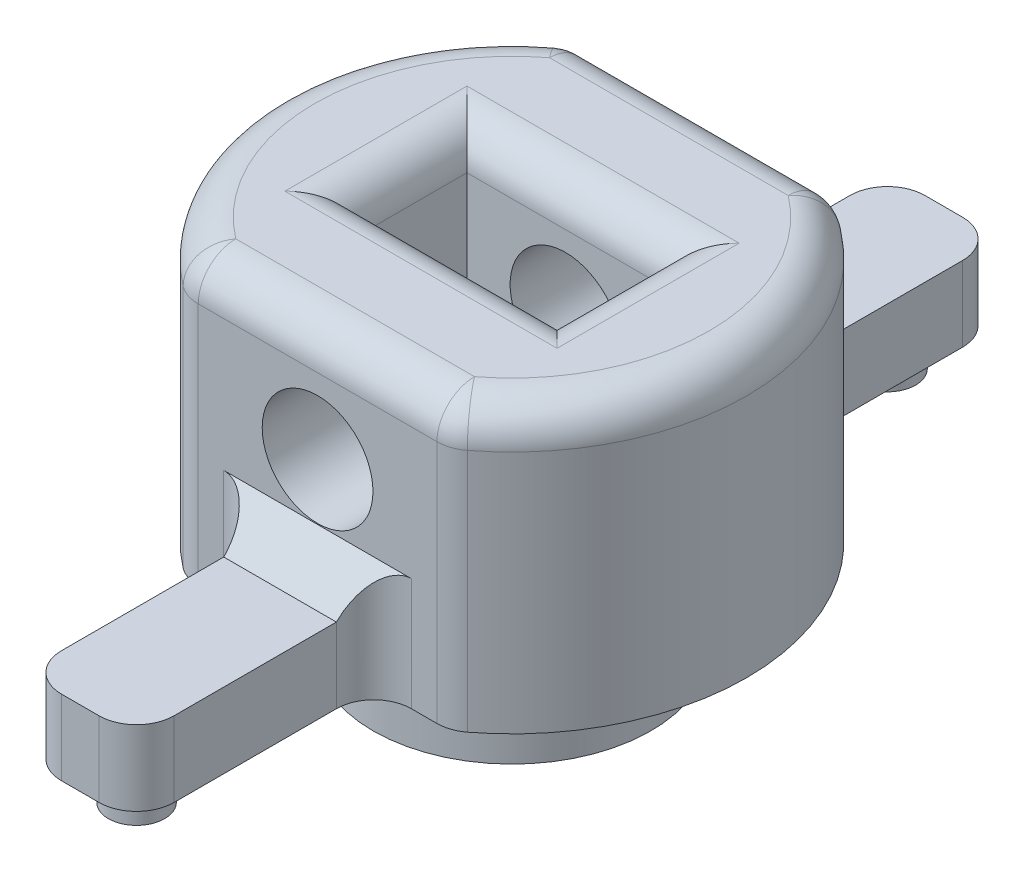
ISO-10303-21;
HEADER;
FILE_DESCRIPTION(('STEP AP214'),'2;1');
FILE_NAME('part.step','',(''),(''),'','','');
FILE_SCHEMA(('AUTOMOTIVE_DESIGN { 1 0 10303 214 1 1 1 1 }'));
ENDSEC;
DATA;
#1=APPLICATION_CONTEXT('core data for automotive mechanical design processes');
#2=APPLICATION_PROTOCOL_DEFINITION('international standard','automotive_design',2000,#1);
#3=PRODUCT_CONTEXT('',#1,'mechanical');
#4=PRODUCT('Part','Part','',(#3));
#5=PRODUCT_RELATED_PRODUCT_CATEGORY('part','',(#4));
#6=PRODUCT_DEFINITION_FORMATION('','',#4);
#7=PRODUCT_DEFINITION_CONTEXT('part definition',#1,'design');
#8=PRODUCT_DEFINITION('design','',#6,#7);
#9=PRODUCT_DEFINITION_SHAPE('','',#8);
#10=(LENGTH_UNIT() NAMED_UNIT(*) SI_UNIT(.MILLI.,.METRE.));
#11=(NAMED_UNIT(*) PLANE_ANGLE_UNIT() SI_UNIT($,.RADIAN.));
#12=(NAMED_UNIT(*) SI_UNIT($,.STERADIAN.) SOLID_ANGLE_UNIT());
#13=UNCERTAINTY_MEASURE_WITH_UNIT(LENGTH_MEASURE(1.E-05),#10,'distance_accuracy_value','');
#14=(GEOMETRIC_REPRESENTATION_CONTEXT(3) GLOBAL_UNCERTAINTY_ASSIGNED_CONTEXT((#13)) GLOBAL_UNIT_ASSIGNED_CONTEXT((#10,
#11,#12)) REPRESENTATION_CONTEXT('',''));
#15=CARTESIAN_POINT('',(0.,0.,0.));
#16=DIRECTION('',(0.,0.,1.));
#17=DIRECTION('',(1.,0.,0.));
#18=AXIS2_PLACEMENT_3D('',#15,#16,#17);
#19=CARTESIAN_POINT('',(0.,9.,-12.5));
#20=DIRECTION('',(0.,0.,1.));
#21=DIRECTION('',(1.,0.,0.));
#22=AXIS2_PLACEMENT_3D('',#19,#20,#21);
#23=CYLINDRICAL_SURFACE('',#22,2.95);
#24=CARTESIAN_POINT('',(0.,9.,-10.356157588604));
#25=DIRECTION('',(0.,0.,1.));
#26=DIRECTION('',(1.,0.,0.));
#27=AXIS2_PLACEMENT_3D('',#24,#25,#26);
#28=CIRCLE('',#27,2.95);
#29=CARTESIAN_POINT('',(2.95,9.,-10.356157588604));
#30=VERTEX_POINT('',#29);
#31=EDGE_CURVE('E419',#30,#30,#28,.F.);
#32=ORIENTED_EDGE('',*,*,#31,.T.);
#33=EDGE_LOOP('',(#32));
#34=FACE_BOUND('',#33,.T.);
#35=CARTESIAN_POINT('',(0.,9.,-2.85));
#36=DIRECTION('',(0.,0.,1.));
#37=DIRECTION('',(1.,0.,0.));
#38=AXIS2_PLACEMENT_3D('',#35,#36,#37);
#39=CIRCLE('',#38,2.95);
#40=CARTESIAN_POINT('',(2.95,9.,-2.85));
#41=VERTEX_POINT('',#40);
#42=EDGE_CURVE('E299',#41,#41,#39,.F.);
#43=ORIENTED_EDGE('',*,*,#42,.F.);
#44=EDGE_LOOP('',(#43));
#45=FACE_BOUND('',#44,.T.);
#46=ADVANCED_FACE('F49',(#34,#45),#23,.F.);
#47=CARTESIAN_POINT('',(0.,20.,0.));
#48=DIRECTION('',(0.,-1.,0.));
#49=DIRECTION('',(0.,0.,-1.));
#50=AXIS2_PLACEMENT_3D('',#47,#48,#49);
#51=CYLINDRICAL_SURFACE('',#50,1.5);
#52=CARTESIAN_POINT('',(0.,-5.,0.));
#53=DIRECTION('',(0.,1.,0.));
#54=DIRECTION('',(0.,0.,1.));
#55=AXIS2_PLACEMENT_3D('',#52,#53,#54);
#56=CIRCLE('',#55,1.5);
#57=CARTESIAN_POINT('',(0.,-5.,1.5));
#58=VERTEX_POINT('',#57);
#59=EDGE_CURVE('E420',#58,#58,#56,.T.);
#60=ORIENTED_EDGE('',*,*,#59,.F.);
#61=EDGE_LOOP('',(#60));
#62=FACE_BOUND('',#61,.T.);
#63=CARTESIAN_POINT('',(0.,2.93782217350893,0.));
#64=DIRECTION('',(-0.5,0.866025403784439,0.));
#65=DIRECTION('',(-0.866025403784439,-0.5,0.));
#66=AXIS2_PLACEMENT_3D('',#63,#64,#65);
#67=ELLIPSE('',#66,1.73205080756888,1.5);
#68=CARTESIAN_POINT('',(0.,2.93782217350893,-1.5));
#69=VERTEX_POINT('',#68);
#70=CARTESIAN_POINT('',(0.,2.93782217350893,1.5));
#71=VERTEX_POINT('',#70);
#72=EDGE_CURVE('E13',#69,#71,#67,.F.);
#73=ORIENTED_EDGE('',*,*,#72,.F.);
#74=CARTESIAN_POINT('',(0.,2.93782217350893,0.));
#75=DIRECTION('',(0.5,0.866025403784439,0.));
#76=DIRECTION('',(0.866025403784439,-0.5,0.));
#77=AXIS2_PLACEMENT_3D('',#74,#75,#76);
#78=ELLIPSE('',#77,1.73205080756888,1.5);
#79=EDGE_CURVE('E64',#71,#69,#78,.F.);
#80=ORIENTED_EDGE('',*,*,#79,.F.);
#81=EDGE_LOOP('',(#73,#80));
#82=FACE_BOUND('',#81,.T.);
#83=ADVANCED_FACE('F269',(#62,#82),#51,.F.);
#84=CARTESIAN_POINT('',(-7.,-5.,10.356157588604));
#85=DIRECTION('',(0.,0.,-1.));
#86=DIRECTION('',(-1.,0.,0.));
#87=AXIS2_PLACEMENT_3D('',#84,#85,#86);
#88=PLANE('',#87);
#89=CARTESIAN_POINT('',(0.,9.,10.356157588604));
#90=DIRECTION('',(0.,0.,-1.));
#91=DIRECTION('',(-1.,0.,0.));
#92=AXIS2_PLACEMENT_3D('',#89,#90,#91);
#93=CIRCLE('',#92,2.95);
#94=CARTESIAN_POINT('',(-2.95,9.,10.356157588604));
#95=VERTEX_POINT('',#94);
#96=EDGE_CURVE('E408',#95,#95,#93,.F.);
#97=ORIENTED_EDGE('',*,*,#96,.F.);
#98=EDGE_LOOP('',(#97));
#99=FACE_BOUND('',#98,.T.);
#100=DIRECTION('',(0.,-1.,0.));
#101=VECTOR('',#100,1.);
#102=CARTESIAN_POINT('',(6.35803667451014,-5.,10.356157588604));
#103=LINE('',#102,#101);
#104=CARTESIAN_POINT('',(6.35803667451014,0.,10.356157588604));
#105=VERTEX_POINT('',#104);
#106=CARTESIAN_POINT('',(6.35803667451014,13.,10.356157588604));
#107=VERTEX_POINT('',#106);
#108=EDGE_CURVE('E467',#105,#107,#103,.F.);
#109=ORIENTED_EDGE('',*,*,#108,.T.);
#110=DIRECTION('',(-1.,0.,0.));
#111=VECTOR('',#110,1.);
#112=CARTESIAN_POINT('',(-6.35803667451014,13.,10.356157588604));
#113=LINE('',#112,#111);
#114=CARTESIAN_POINT('',(-6.35803667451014,13.,10.356157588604));
#115=VERTEX_POINT('',#114);
#116=EDGE_CURVE('E600',#107,#115,#113,.T.);
#117=ORIENTED_EDGE('',*,*,#116,.T.);
#118=DIRECTION('',(0.,-1.,0.));
#119=VECTOR('',#118,1.);
#120=CARTESIAN_POINT('',(-6.35803667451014,-5.,10.356157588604));
#121=LINE('',#120,#119);
#122=CARTESIAN_POINT('',(-6.35803667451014,0.,10.356157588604));
#123=VERTEX_POINT('',#122);
#124=EDGE_CURVE('E475',#115,#123,#121,.T.);
#125=ORIENTED_EDGE('',*,*,#124,.T.);
#126=DIRECTION('',(-1.,0.,0.));
#127=VECTOR('',#126,1.);
#128=CARTESIAN_POINT('',(0.,0.,10.356157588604));
#129=LINE('',#128,#127);
#130=CARTESIAN_POINT('',(-5.,0.,10.356157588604));
#131=VERTEX_POINT('',#130);
#132=EDGE_CURVE('E409',#131,#123,#129,.T.);
#133=ORIENTED_EDGE('',*,*,#132,.F.);
#134=DIRECTION('',(0.,-1.,0.));
#135=VECTOR('',#134,1.);
#136=CARTESIAN_POINT('',(-5.,6.,10.356157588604));
#137=LINE('',#136,#135);
#138=CARTESIAN_POINT('',(-5.,6.,10.356157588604));
#139=VERTEX_POINT('',#138);
#140=EDGE_CURVE('E478',#131,#139,#137,.F.);
#141=ORIENTED_EDGE('',*,*,#140,.T.);
#142=DIRECTION('',(1.,0.,0.));
#143=VECTOR('',#142,1.);
#144=CARTESIAN_POINT('',(-7.,6.,10.356157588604));
#145=LINE('',#144,#143);
#146=CARTESIAN_POINT('',(5.,6.,10.356157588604));
#147=VERTEX_POINT('',#146);
#148=EDGE_CURVE('E456',#139,#147,#145,.T.);
#149=ORIENTED_EDGE('',*,*,#148,.T.);
#150=DIRECTION('',(0.,-1.,0.));
#151=VECTOR('',#150,1.);
#152=CARTESIAN_POINT('',(5.,-5.,10.356157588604));
#153=LINE('',#152,#151);
#154=CARTESIAN_POINT('',(5.,0.,10.356157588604));
#155=VERTEX_POINT('',#154);
#156=EDGE_CURVE('E471',#147,#155,#153,.T.);
#157=ORIENTED_EDGE('',*,*,#156,.T.);
#158=EDGE_CURVE('E413',#105,#155,#129,.T.);
#159=ORIENTED_EDGE('',*,*,#158,.F.);
#160=EDGE_LOOP('',(#109,#117,#125,#133,#141,#149,#157,#159));
#161=FACE_BOUND('',#160,.T.);
#162=ADVANCED_FACE('F735',(#99,#161),#88,.F.);
#163=CARTESIAN_POINT('',(-7.,-5.,-10.356157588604));
#164=DIRECTION('',(0.,0.,1.));
#165=DIRECTION('',(1.,0.,0.));
#166=AXIS2_PLACEMENT_3D('',#163,#164,#165);
#167=PLANE('',#166);
#168=ORIENTED_EDGE('',*,*,#31,.F.);
#169=EDGE_LOOP('',(#168));
#170=FACE_BOUND('',#169,.T.);
#171=DIRECTION('',(0.,-1.,0.));
#172=VECTOR('',#171,1.);
#173=CARTESIAN_POINT('',(-6.35803667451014,-5.,-10.356157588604));
#174=LINE('',#173,#172);
#175=CARTESIAN_POINT('',(-6.35803667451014,0.,-10.356157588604));
#176=VERTEX_POINT('',#175);
#177=CARTESIAN_POINT('',(-6.35803667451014,13.,-10.356157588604));
#178=VERTEX_POINT('',#177);
#179=EDGE_CURVE('E514',#176,#178,#174,.F.);
#180=ORIENTED_EDGE('',*,*,#179,.T.);
#181=DIRECTION('',(1.,0.,0.));
#182=VECTOR('',#181,1.);
#183=CARTESIAN_POINT('',(6.35803667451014,13.,-10.356157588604));
#184=LINE('',#183,#182);
#185=CARTESIAN_POINT('',(6.35803667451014,13.,-10.356157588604));
#186=VERTEX_POINT('',#185);
#187=EDGE_CURVE('E562',#178,#186,#184,.T.);
#188=ORIENTED_EDGE('',*,*,#187,.T.);
#189=DIRECTION('',(0.,-1.,0.));
#190=VECTOR('',#189,1.);
#191=CARTESIAN_POINT('',(6.35803667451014,-5.,-10.356157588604));
#192=LINE('',#191,#190);
#193=CARTESIAN_POINT('',(6.35803667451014,0.,-10.356157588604));
#194=VERTEX_POINT('',#193);
#195=EDGE_CURVE('E522',#186,#194,#192,.T.);
#196=ORIENTED_EDGE('',*,*,#195,.T.);
#197=DIRECTION('',(1.,0.,0.));
#198=VECTOR('',#197,1.);
#199=CARTESIAN_POINT('',(0.,0.,-10.356157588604));
#200=LINE('',#199,#198);
#201=CARTESIAN_POINT('',(5.,0.,-10.356157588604));
#202=VERTEX_POINT('',#201);
#203=EDGE_CURVE('E414',#202,#194,#200,.T.);
#204=ORIENTED_EDGE('',*,*,#203,.F.);
#205=DIRECTION('',(0.,1.,0.));
#206=VECTOR('',#205,1.);
#207=CARTESIAN_POINT('',(5.,-5.,-10.356157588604));
#208=LINE('',#207,#206);
#209=CARTESIAN_POINT('',(5.,6.,-10.356157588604));
#210=VERTEX_POINT('',#209);
#211=EDGE_CURVE('E518',#202,#210,#208,.T.);
#212=ORIENTED_EDGE('',*,*,#211,.T.);
#213=DIRECTION('',(-1.,0.,0.));
#214=VECTOR('',#213,1.);
#215=CARTESIAN_POINT('',(-7.,6.,-10.356157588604));
#216=LINE('',#215,#214);
#217=CARTESIAN_POINT('',(-5.,6.,-10.356157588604));
#218=VERTEX_POINT('',#217);
#219=EDGE_CURVE('E434',#210,#218,#216,.T.);
#220=ORIENTED_EDGE('',*,*,#219,.T.);
#221=DIRECTION('',(0.,1.,0.));
#222=VECTOR('',#221,1.);
#223=CARTESIAN_POINT('',(-5.,0.,-10.356157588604));
#224=LINE('',#223,#222);
#225=CARTESIAN_POINT('',(-5.,0.,-10.356157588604));
#226=VERTEX_POINT('',#225);
#227=EDGE_CURVE('E511',#218,#226,#224,.F.);
#228=ORIENTED_EDGE('',*,*,#227,.T.);
#229=EDGE_CURVE('E418',#176,#226,#200,.T.);
#230=ORIENTED_EDGE('',*,*,#229,.F.);
#231=EDGE_LOOP('',(#180,#188,#196,#204,#212,#220,#228,#230));
#232=FACE_BOUND('',#231,.T.);
#233=ADVANCED_FACE('F759',(#170,#232),#167,.F.);
#234=CARTESIAN_POINT('',(0.,15.,0.));
#235=DIRECTION('',(0.,-1.,0.));
#236=DIRECTION('',(0.,0.,-1.));
#237=AXIS2_PLACEMENT_3D('',#234,#235,#236);
#238=CYLINDRICAL_SURFACE('',#237,12.5);
#239=DIRECTION('',(0.,-1.,0.));
#240=VECTOR('',#239,1.);
#241=CARTESIAN_POINT('',(7.56909127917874,15.,-9.94780665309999));
#242=LINE('',#241,#240);
#243=CARTESIAN_POINT('',(7.56909127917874,0.,-9.94780665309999));
#244=VERTEX_POINT('',#243);
#245=CARTESIAN_POINT('',(7.56909127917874,13.,-9.94780665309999));
#246=VERTEX_POINT('',#245);
#247=EDGE_CURVE('E504',#244,#246,#242,.F.);
#248=ORIENTED_EDGE('',*,*,#247,.T.);
#249=CARTESIAN_POINT('',(0.,13.,0.));
#250=DIRECTION('',(0.,1.,0.));
#251=DIRECTION('',(0.,0.,1.));
#252=AXIS2_PLACEMENT_3D('',#249,#250,#251);
#253=CIRCLE('',#252,12.5);
#254=CARTESIAN_POINT('',(7.56909127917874,13.,9.94780665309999));
#255=VERTEX_POINT('',#254);
#256=EDGE_CURVE('E594',#246,#255,#253,.F.);
#257=ORIENTED_EDGE('',*,*,#256,.T.);
#258=DIRECTION('',(0.,-1.,0.));
#259=VECTOR('',#258,1.);
#260=CARTESIAN_POINT('',(7.56909127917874,15.,9.94780665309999));
#261=LINE('',#260,#259);
#262=CARTESIAN_POINT('',(7.56909127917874,0.,9.94780665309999));
#263=VERTEX_POINT('',#262);
#264=EDGE_CURVE('E508',#255,#263,#261,.T.);
#265=ORIENTED_EDGE('',*,*,#264,.T.);
#266=CARTESIAN_POINT('',(0.,0.,0.));
#267=DIRECTION('',(0.,1.,0.));
#268=DIRECTION('',(0.,0.,1.));
#269=AXIS2_PLACEMENT_3D('',#266,#267,#268);
#270=CIRCLE('',#269,12.5);
#271=EDGE_CURVE('E425',#263,#244,#270,.T.);
#272=ORIENTED_EDGE('',*,*,#271,.T.);
#273=EDGE_LOOP('',(#248,#257,#265,#272));
#274=FACE_BOUND('',#273,.T.);
#275=ADVANCED_FACE('F896',(#274),#238,.T.);
#276=CARTESIAN_POINT('',(0.,-5.,0.));
#277=DIRECTION('',(0.,1.,0.));
#278=DIRECTION('',(0.,0.,1.));
#279=AXIS2_PLACEMENT_3D('',#276,#277,#278);
#280=CYLINDRICAL_SURFACE('',#279,7.4);
#281=CARTESIAN_POINT('',(0.,-5.,0.));
#282=DIRECTION('',(0.,1.,0.));
#283=DIRECTION('',(0.,0.,1.));
#284=AXIS2_PLACEMENT_3D('',#281,#282,#283);
#285=CIRCLE('',#284,7.4);
#286=CARTESIAN_POINT('',(0.,-5.,7.4));
#287=VERTEX_POINT('',#286);
#288=EDGE_CURVE('E430',#287,#287,#285,.T.);
#289=ORIENTED_EDGE('',*,*,#288,.T.);
#290=EDGE_LOOP('',(#289));
#291=FACE_BOUND('',#290,.T.);
#292=CARTESIAN_POINT('',(0.,0.,0.));
#293=DIRECTION('',(0.,1.,0.));
#294=DIRECTION('',(0.,0.,1.));
#295=AXIS2_PLACEMENT_3D('',#292,#293,#294);
#296=CIRCLE('',#295,7.4);
#297=CARTESIAN_POINT('',(0.,0.,7.4));
#298=VERTEX_POINT('',#297);
#299=EDGE_CURVE('E429',#298,#298,#296,.T.);
#300=ORIENTED_EDGE('',*,*,#299,.F.);
#301=EDGE_LOOP('',(#300));
#302=FACE_BOUND('',#301,.T.);
#303=ADVANCED_FACE('F1079',(#291,#302),#280,.T.);
#304=CARTESIAN_POINT('',(0.,-5.,0.));
#305=DIRECTION('',(0.,1.,0.));
#306=DIRECTION('',(0.,0.,1.));
#307=AXIS2_PLACEMENT_3D('',#304,#305,#306);
#308=PLANE('',#307);
#309=ORIENTED_EDGE('',*,*,#59,.T.);
#310=EDGE_LOOP('',(#309));
#311=FACE_BOUND('',#310,.T.);
#312=ORIENTED_EDGE('',*,*,#288,.F.);
#313=EDGE_LOOP('',(#312));
#314=FACE_BOUND('',#313,.T.);
#315=ADVANCED_FACE('F1068',(#311,#314),#308,.F.);
#316=DIRECTION('',(0.,-1.,0.));
#317=VECTOR('',#316,1.);
#318=CARTESIAN_POINT('',(-7.56909127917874,15.,9.94780665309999));
#319=LINE('',#318,#317);
#320=CARTESIAN_POINT('',(-7.56909127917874,0.,9.94780665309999));
#321=VERTEX_POINT('',#320);
#322=CARTESIAN_POINT('',(-7.56909127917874,13.,9.94780665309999));
#323=VERTEX_POINT('',#322);
#324=EDGE_CURVE('E485',#321,#323,#319,.F.);
#325=ORIENTED_EDGE('',*,*,#324,.T.);
#326=CARTESIAN_POINT('',(0.,13.,0.));
#327=DIRECTION('',(0.,1.,0.));
#328=DIRECTION('',(0.,0.,1.));
#329=AXIS2_PLACEMENT_3D('',#326,#327,#328);
#330=CIRCLE('',#329,12.5);
#331=CARTESIAN_POINT('',(-7.56909127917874,13.,-9.94780665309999));
#332=VERTEX_POINT('',#331);
#333=EDGE_CURVE('E606',#323,#332,#330,.F.);
#334=ORIENTED_EDGE('',*,*,#333,.T.);
#335=DIRECTION('',(0.,-1.,0.));
#336=VECTOR('',#335,1.);
#337=CARTESIAN_POINT('',(-7.56909127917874,15.,-9.94780665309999));
#338=LINE('',#337,#336);
#339=CARTESIAN_POINT('',(-7.56909127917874,0.,-9.94780665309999));
#340=VERTEX_POINT('',#339);
#341=EDGE_CURVE('E482',#332,#340,#338,.T.);
#342=ORIENTED_EDGE('',*,*,#341,.T.);
#343=EDGE_CURVE('E424',#340,#321,#270,.T.);
#344=ORIENTED_EDGE('',*,*,#343,.T.);
#345=EDGE_LOOP('',(#325,#334,#342,#344));
#346=FACE_BOUND('',#345,.T.);
#347=ADVANCED_FACE('F788',(#346),#238,.T.);
#348=CARTESIAN_POINT('',(0.,15.,0.));
#349=DIRECTION('',(0.,1.,0.));
#350=DIRECTION('',(0.,0.,1.));
#351=AXIS2_PLACEMENT_3D('',#348,#349,#350);
#352=PLANE('',#351);
#353=CARTESIAN_POINT('',(0.,15.,0.));
#354=DIRECTION('',(0.,1.,0.));
#355=DIRECTION('',(0.,0.,1.));
#356=AXIS2_PLACEMENT_3D('',#353,#354,#355);
#357=CIRCLE('',#356,10.5);
#358=CARTESIAN_POINT('',(6.35803667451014,15.,8.35615758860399));
#359=VERTEX_POINT('',#358);
#360=CARTESIAN_POINT('',(6.35803667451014,15.,-8.35615758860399));
#361=VERTEX_POINT('',#360);
#362=EDGE_CURVE('E584',#359,#361,#357,.T.);
#363=ORIENTED_EDGE('',*,*,#362,.T.);
#364=DIRECTION('',(1.,0.,0.));
#365=VECTOR('',#364,1.);
#366=CARTESIAN_POINT('',(-6.35803667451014,15.,-8.35615758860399));
#367=LINE('',#366,#365);
#368=CARTESIAN_POINT('',(-6.35803667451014,15.,-8.35615758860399));
#369=VERTEX_POINT('',#368);
#370=EDGE_CURVE('E587',#361,#369,#367,.F.);
#371=ORIENTED_EDGE('',*,*,#370,.T.);
#372=CARTESIAN_POINT('',(0.,15.,0.));
#373=DIRECTION('',(0.,1.,0.));
#374=DIRECTION('',(0.,0.,1.));
#375=AXIS2_PLACEMENT_3D('',#372,#373,#374);
#376=CIRCLE('',#375,10.5);
#377=CARTESIAN_POINT('',(-6.35803667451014,15.,8.35615758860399));
#378=VERTEX_POINT('',#377);
#379=EDGE_CURVE('E578',#369,#378,#376,.T.);
#380=ORIENTED_EDGE('',*,*,#379,.T.);
#381=DIRECTION('',(-1.,0.,0.));
#382=VECTOR('',#381,1.);
#383=CARTESIAN_POINT('',(6.35803667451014,15.,8.35615758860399));
#384=LINE('',#383,#382);
#385=EDGE_CURVE('E581',#378,#359,#384,.F.);
#386=ORIENTED_EDGE('',*,*,#385,.T.);
#387=EDGE_LOOP('',(#363,#371,#380,#386));
#388=FACE_BOUND('',#387,.T.);
#389=DIRECTION('',(1.,0.,0.));
#390=VECTOR('',#389,1.);
#391=CARTESIAN_POINT('',(0.,15.,-4.85));
#392=LINE('',#391,#390);
#393=CARTESIAN_POINT('',(-7.25,15.,-4.85));
#394=VERTEX_POINT('',#393);
#395=CARTESIAN_POINT('',(7.25,15.,-4.85));
#396=VERTEX_POINT('',#395);
#397=EDGE_CURVE('E571',#394,#396,#392,.T.);
#398=ORIENTED_EDGE('',*,*,#397,.T.);
#399=DIRECTION('',(0.,0.,-1.));
#400=VECTOR('',#399,1.);
#401=CARTESIAN_POINT('',(7.25,15.,0.));
#402=LINE('',#401,#400);
#403=CARTESIAN_POINT('',(7.25,15.,4.85));
#404=VERTEX_POINT('',#403);
#405=EDGE_CURVE('E574',#396,#404,#402,.F.);
#406=ORIENTED_EDGE('',*,*,#405,.T.);
#407=DIRECTION('',(1.,0.,0.));
#408=VECTOR('',#407,1.);
#409=CARTESIAN_POINT('',(-5.25,15.,4.85));
#410=LINE('',#409,#408);
#411=CARTESIAN_POINT('',(-7.25,15.,4.85));
#412=VERTEX_POINT('',#411);
#413=EDGE_CURVE('E565',#404,#412,#410,.F.);
#414=ORIENTED_EDGE('',*,*,#413,.T.);
#415=DIRECTION('',(0.,0.,-1.));
#416=VECTOR('',#415,1.);
#417=CARTESIAN_POINT('',(-7.25,15.,-2.85));
#418=LINE('',#417,#416);
#419=EDGE_CURVE('E568',#412,#394,#418,.T.);
#420=ORIENTED_EDGE('',*,*,#419,.T.);
#421=EDGE_LOOP('',(#398,#406,#414,#420));
#422=FACE_BOUND('',#421,.T.);
#423=ADVANCED_FACE('F673',(#388,#422),#352,.T.);
#424=CARTESIAN_POINT('',(0.,0.,0.));
#425=DIRECTION('',(0.,1.,0.));
#426=DIRECTION('',(0.,0.,1.));
#427=AXIS2_PLACEMENT_3D('',#424,#425,#426);
#428=PLANE('',#427);
#429=CARTESIAN_POINT('',(0.,0.,-20.));
#430=DIRECTION('',(0.,1.,0.));
#431=DIRECTION('',(0.,0.,1.));
#432=AXIS2_PLACEMENT_3D('',#429,#430,#431);
#433=CIRCLE('',#432,1.5);
#434=CARTESIAN_POINT('',(0.,0.,-18.5));
#435=VERTEX_POINT('',#434);
#436=EDGE_CURVE('E305',#435,#435,#433,.T.);
#437=ORIENTED_EDGE('',*,*,#436,.T.);
#438=EDGE_LOOP('',(#437));
#439=FACE_BOUND('',#438,.T.);
#440=CARTESIAN_POINT('',(0.,0.,20.));
#441=DIRECTION('',(0.,1.,0.));
#442=DIRECTION('',(0.,0.,1.));
#443=AXIS2_PLACEMENT_3D('',#440,#441,#442);
#444=CIRCLE('',#443,1.5);
#445=CARTESIAN_POINT('',(0.,0.,21.5));
#446=VERTEX_POINT('',#445);
#447=EDGE_CURVE('E304',#446,#446,#444,.T.);
#448=ORIENTED_EDGE('',*,*,#447,.T.);
#449=EDGE_LOOP('',(#448));
#450=FACE_BOUND('',#449,.T.);
#451=ORIENTED_EDGE('',*,*,#299,.T.);
#452=EDGE_LOOP('',(#451));
#453=FACE_BOUND('',#452,.T.);
#454=ORIENTED_EDGE('',*,*,#132,.T.);
#455=CARTESIAN_POINT('',(-6.35803667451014,0.,8.35615758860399));
#456=DIRECTION('',(0.,1.,0.));
#457=DIRECTION('',(0.,0.,1.));
#458=AXIS2_PLACEMENT_3D('',#455,#456,#457);
#459=CIRCLE('',#458,2.);
#460=EDGE_CURVE('E498',#123,#321,#459,.F.);
#461=ORIENTED_EDGE('',*,*,#460,.T.);
#462=ORIENTED_EDGE('',*,*,#343,.F.);
#463=CARTESIAN_POINT('',(-6.35803667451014,0.,-8.35615758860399));
#464=DIRECTION('',(0.,1.,0.));
#465=DIRECTION('',(0.,0.,1.));
#466=AXIS2_PLACEMENT_3D('',#463,#464,#465);
#467=CIRCLE('',#466,2.);
#468=EDGE_CURVE('E489',#340,#176,#467,.F.);
#469=ORIENTED_EDGE('',*,*,#468,.T.);
#470=ORIENTED_EDGE('',*,*,#229,.T.);
#471=CARTESIAN_POINT('',(-5.,0.,-12.356157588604));
#472=DIRECTION('',(0.,1.,0.));
#473=DIRECTION('',(0.,0.,1.));
#474=AXIS2_PLACEMENT_3D('',#471,#472,#473);
#475=CIRCLE('',#474,2.);
#476=CARTESIAN_POINT('',(-3.,0.,-12.356157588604));
#477=VERTEX_POINT('',#476);
#478=EDGE_CURVE('E555',#226,#477,#475,.T.);
#479=ORIENTED_EDGE('',*,*,#478,.T.);
#480=DIRECTION('',(0.,0.,1.));
#481=VECTOR('',#480,1.);
#482=CARTESIAN_POINT('',(-3.,0.,0.));
#483=LINE('',#482,#481);
#484=CARTESIAN_POINT('',(-3.,0.,-21.));
#485=VERTEX_POINT('',#484);
#486=EDGE_CURVE('E358',#485,#477,#483,.T.);
#487=ORIENTED_EDGE('',*,*,#486,.F.);
#488=CARTESIAN_POINT('',(-1.,0.,-21.));
#489=DIRECTION('',(0.,1.,0.));
#490=DIRECTION('',(0.,0.,1.));
#491=AXIS2_PLACEMENT_3D('',#488,#489,#490);
#492=CIRCLE('',#491,2.);
#493=CARTESIAN_POINT('',(-0.999999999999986,0.,-23.));
#494=VERTEX_POINT('',#493);
#495=EDGE_CURVE('E354',#494,#485,#492,.T.);
#496=ORIENTED_EDGE('',*,*,#495,.F.);
#497=DIRECTION('',(1.,0.,0.));
#498=VECTOR('',#497,1.);
#499=CARTESIAN_POINT('',(0.,0.,-23.));
#500=LINE('',#499,#498);
#501=CARTESIAN_POINT('',(0.999999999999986,0.,-23.));
#502=VERTEX_POINT('',#501);
#503=EDGE_CURVE('E314',#494,#502,#500,.T.);
#504=ORIENTED_EDGE('',*,*,#503,.T.);
#505=CARTESIAN_POINT('',(1.,0.,-21.));
#506=DIRECTION('',(0.,1.,0.));
#507=DIRECTION('',(0.,0.,1.));
#508=AXIS2_PLACEMENT_3D('',#505,#506,#507);
#509=CIRCLE('',#508,2.);
#510=CARTESIAN_POINT('',(3.,0.,-21.));
#511=VERTEX_POINT('',#510);
#512=EDGE_CURVE('E323',#502,#511,#509,.F.);
#513=ORIENTED_EDGE('',*,*,#512,.T.);
#514=DIRECTION('',(0.,0.,1.));
#515=VECTOR('',#514,1.);
#516=CARTESIAN_POINT('',(3.,0.,0.));
#517=LINE('',#516,#515);
#518=CARTESIAN_POINT('',(3.,0.,-12.356157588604));
#519=VERTEX_POINT('',#518);
#520=EDGE_CURVE('E373',#511,#519,#517,.T.);
#521=ORIENTED_EDGE('',*,*,#520,.T.);
#522=CARTESIAN_POINT('',(5.,0.,-12.356157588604));
#523=DIRECTION('',(0.,1.,0.));
#524=DIRECTION('',(0.,0.,1.));
#525=AXIS2_PLACEMENT_3D('',#522,#523,#524);
#526=CIRCLE('',#525,2.);
#527=EDGE_CURVE('E548',#519,#202,#526,.T.);
#528=ORIENTED_EDGE('',*,*,#527,.T.);
#529=ORIENTED_EDGE('',*,*,#203,.T.);
#530=CARTESIAN_POINT('',(6.35803667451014,0.,-8.35615758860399));
#531=DIRECTION('',(0.,1.,0.));
#532=DIRECTION('',(0.,0.,1.));
#533=AXIS2_PLACEMENT_3D('',#530,#531,#532);
#534=CIRCLE('',#533,2.);
#535=EDGE_CURVE('E492',#194,#244,#534,.F.);
#536=ORIENTED_EDGE('',*,*,#535,.T.);
#537=ORIENTED_EDGE('',*,*,#271,.F.);
#538=CARTESIAN_POINT('',(6.35803667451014,0.,8.35615758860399));
#539=DIRECTION('',(0.,1.,0.));
#540=DIRECTION('',(0.,0.,1.));
#541=AXIS2_PLACEMENT_3D('',#538,#539,#540);
#542=CIRCLE('',#541,2.);
#543=EDGE_CURVE('E495',#263,#105,#542,.F.);
#544=ORIENTED_EDGE('',*,*,#543,.T.);
#545=ORIENTED_EDGE('',*,*,#158,.T.);
#546=CARTESIAN_POINT('',(5.,0.,12.356157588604));
#547=DIRECTION('',(0.,1.,0.));
#548=DIRECTION('',(0.,0.,1.));
#549=AXIS2_PLACEMENT_3D('',#546,#547,#548);
#550=CIRCLE('',#549,2.);
#551=CARTESIAN_POINT('',(3.,0.,12.356157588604));
#552=VERTEX_POINT('',#551);
#553=EDGE_CURVE('E538',#155,#552,#550,.T.);
#554=ORIENTED_EDGE('',*,*,#553,.T.);
#555=CARTESIAN_POINT('',(3.00000000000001,0.,21.));
#556=VERTEX_POINT('',#555);
#557=EDGE_CURVE('E372',#552,#556,#517,.T.);
#558=ORIENTED_EDGE('',*,*,#557,.T.);
#559=CARTESIAN_POINT('',(1.00000000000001,0.,21.));
#560=DIRECTION('',(0.,1.,0.));
#561=DIRECTION('',(0.,0.,1.));
#562=AXIS2_PLACEMENT_3D('',#559,#560,#561);
#563=CIRCLE('',#562,2.);
#564=CARTESIAN_POINT('',(0.999999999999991,0.,23.));
#565=VERTEX_POINT('',#564);
#566=EDGE_CURVE('E368',#565,#556,#563,.T.);
#567=ORIENTED_EDGE('',*,*,#566,.F.);
#568=DIRECTION('',(1.,0.,0.));
#569=VECTOR('',#568,1.);
#570=CARTESIAN_POINT('',(0.,0.,23.));
#571=LINE('',#570,#569);
#572=CARTESIAN_POINT('',(-0.99999999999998,0.,23.));
#573=VERTEX_POINT('',#572);
#574=EDGE_CURVE('E365',#573,#565,#571,.T.);
#575=ORIENTED_EDGE('',*,*,#574,.F.);
#576=CARTESIAN_POINT('',(-0.999999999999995,0.,21.));
#577=DIRECTION('',(0.,1.,0.));
#578=DIRECTION('',(0.,0.,1.));
#579=AXIS2_PLACEMENT_3D('',#576,#577,#578);
#580=CIRCLE('',#579,2.);
#581=CARTESIAN_POINT('',(-2.99999999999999,0.,21.));
#582=VERTEX_POINT('',#581);
#583=EDGE_CURVE('E362',#582,#573,#580,.T.);
#584=ORIENTED_EDGE('',*,*,#583,.F.);
#585=CARTESIAN_POINT('',(-3.,0.,12.356157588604));
#586=VERTEX_POINT('',#585);
#587=EDGE_CURVE('E357',#586,#582,#483,.T.);
#588=ORIENTED_EDGE('',*,*,#587,.F.);
#589=CARTESIAN_POINT('',(-5.,0.,12.356157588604));
#590=DIRECTION('',(0.,1.,0.));
#591=DIRECTION('',(0.,0.,1.));
#592=AXIS2_PLACEMENT_3D('',#589,#590,#591);
#593=CIRCLE('',#592,2.);
#594=EDGE_CURVE('E532',#586,#131,#593,.T.);
#595=ORIENTED_EDGE('',*,*,#594,.T.);
#596=EDGE_LOOP('',(#454,#461,#462,#469,#470,#479,#487,#496,#504,#513,#521,#528,#529,#536,#537,
#544,#545,#554,#558,#567,#575,#584,#588,#595));
#597=FACE_BOUND('',#596,.T.);
#598=ADVANCED_FACE('F742',(#439,#450,#453,#597),#428,.F.);
#599=CARTESIAN_POINT('',(0.,9.,2.85));
#600=DIRECTION('',(0.,0.,1.));
#601=DIRECTION('',(1.,0.,0.));
#602=AXIS2_PLACEMENT_3D('',#599,#600,#601);
#603=CIRCLE('',#602,2.95);
#604=CARTESIAN_POINT('',(2.95,9.,2.85));
#605=VERTEX_POINT('',#604);
#606=EDGE_CURVE('E309',#605,#605,#603,.F.);
#607=ORIENTED_EDGE('',*,*,#606,.T.);
#608=EDGE_LOOP('',(#607));
#609=FACE_BOUND('',#608,.T.);
#610=ORIENTED_EDGE('',*,*,#96,.T.);
#611=EDGE_LOOP('',(#610));
#612=FACE_BOUND('',#611,.T.);
#613=ADVANCED_FACE('F731',(#609,#612),#23,.F.);
#614=CARTESIAN_POINT('',(1.,4.,-21.));
#615=DIRECTION('',(0.,-1.,0.));
#616=DIRECTION('',(0.,0.,-1.));
#617=AXIS2_PLACEMENT_3D('',#614,#615,#616);
#618=CYLINDRICAL_SURFACE('',#617,2.);
#619=ORIENTED_EDGE('',*,*,#512,.F.);
#620=DIRECTION('',(0.,-1.,0.));
#621=VECTOR('',#620,1.);
#622=CARTESIAN_POINT('',(0.999999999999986,4.,-23.));
#623=LINE('',#622,#621);
#624=CARTESIAN_POINT('',(0.999999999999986,4.,-23.));
#625=VERTEX_POINT('',#624);
#626=EDGE_CURVE('E350',#625,#502,#623,.T.);
#627=ORIENTED_EDGE('',*,*,#626,.F.);
#628=CARTESIAN_POINT('',(1.,4.,-21.));
#629=DIRECTION('',(0.,1.,0.));
#630=DIRECTION('',(0.,0.,1.));
#631=AXIS2_PLACEMENT_3D('',#628,#629,#630);
#632=CIRCLE('',#631,2.);
#633=CARTESIAN_POINT('',(3.,4.,-21.));
#634=VERTEX_POINT('',#633);
#635=EDGE_CURVE('E346',#625,#634,#632,.F.);
#636=ORIENTED_EDGE('',*,*,#635,.T.);
#637=DIRECTION('',(0.,-1.,0.));
#638=VECTOR('',#637,1.);
#639=CARTESIAN_POINT('',(3.,4.,-21.));
#640=LINE('',#639,#638);
#641=EDGE_CURVE('E382',#634,#511,#640,.T.);
#642=ORIENTED_EDGE('',*,*,#641,.T.);
#643=EDGE_LOOP('',(#619,#627,#636,#642));
#644=FACE_BOUND('',#643,.T.);
#645=ADVANCED_FACE('F741',(#644),#618,.T.);
#646=CARTESIAN_POINT('',(0.,4.,-23.));
#647=DIRECTION('',(0.,0.,-1.));
#648=DIRECTION('',(-1.,0.,0.));
#649=AXIS2_PLACEMENT_3D('',#646,#647,#648);
#650=PLANE('',#649);
#651=ORIENTED_EDGE('',*,*,#503,.F.);
#652=DIRECTION('',(0.,-1.,0.));
#653=VECTOR('',#652,1.);
#654=CARTESIAN_POINT('',(-0.999999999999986,4.,-23.));
#655=LINE('',#654,#653);
#656=CARTESIAN_POINT('',(-0.999999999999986,4.,-23.));
#657=VERTEX_POINT('',#656);
#658=EDGE_CURVE('E405',#657,#494,#655,.T.);
#659=ORIENTED_EDGE('',*,*,#658,.F.);
#660=DIRECTION('',(1.,0.,0.));
#661=VECTOR('',#660,1.);
#662=CARTESIAN_POINT('',(0.,4.,-23.));
#663=LINE('',#662,#661);
#664=EDGE_CURVE('E318',#657,#625,#663,.T.);
#665=ORIENTED_EDGE('',*,*,#664,.T.);
#666=ORIENTED_EDGE('',*,*,#626,.T.);
#667=EDGE_LOOP('',(#651,#659,#665,#666));
#668=FACE_BOUND('',#667,.T.);
#669=ADVANCED_FACE('F748',(#668),#650,.T.);
#670=CARTESIAN_POINT('',(-1.,4.,-21.));
#671=DIRECTION('',(0.,-1.,0.));
#672=DIRECTION('',(0.,0.,-1.));
#673=AXIS2_PLACEMENT_3D('',#670,#671,#672);
#674=CYLINDRICAL_SURFACE('',#673,2.);
#675=ORIENTED_EDGE('',*,*,#495,.T.);
#676=DIRECTION('',(0.,-1.,0.));
#677=VECTOR('',#676,1.);
#678=CARTESIAN_POINT('',(-3.,4.,-21.));
#679=LINE('',#678,#677);
#680=CARTESIAN_POINT('',(-3.,4.,-21.));
#681=VERTEX_POINT('',#680);
#682=EDGE_CURVE('E401',#681,#485,#679,.T.);
#683=ORIENTED_EDGE('',*,*,#682,.F.);
#684=CARTESIAN_POINT('',(-1.,4.,-21.));
#685=DIRECTION('',(0.,1.,0.));
#686=DIRECTION('',(0.,0.,1.));
#687=AXIS2_PLACEMENT_3D('',#684,#685,#686);
#688=CIRCLE('',#687,2.);
#689=EDGE_CURVE('E322',#657,#681,#688,.T.);
#690=ORIENTED_EDGE('',*,*,#689,.F.);
#691=ORIENTED_EDGE('',*,*,#658,.T.);
#692=EDGE_LOOP('',(#675,#683,#690,#691));
#693=FACE_BOUND('',#692,.T.);
#694=ADVANCED_FACE('F861',(#693),#674,.T.);
#695=CARTESIAN_POINT('',(0.,4.,0.));
#696=DIRECTION('',(0.,1.,0.));
#697=DIRECTION('',(0.,0.,1.));
#698=AXIS2_PLACEMENT_3D('',#695,#696,#697);
#699=PLANE('',#698);
#700=DIRECTION('',(0.,0.,1.));
#701=VECTOR('',#700,1.);
#702=CARTESIAN_POINT('',(-3.,4.,0.));
#703=LINE('',#702,#701);
#704=CARTESIAN_POINT('',(-3.,4.,-12.356157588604));
#705=VERTEX_POINT('',#704);
#706=EDGE_CURVE('E327',#681,#705,#703,.T.);
#707=ORIENTED_EDGE('',*,*,#706,.T.);
#708=DIRECTION('',(1.,0.,0.));
#709=VECTOR('',#708,1.);
#710=CARTESIAN_POINT('',(0.,4.,-12.356157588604));
#711=LINE('',#710,#709);
#712=CARTESIAN_POINT('',(3.,4.,-12.356157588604));
#713=VERTEX_POINT('',#712);
#714=EDGE_CURVE('E452',#705,#713,#711,.T.);
#715=ORIENTED_EDGE('',*,*,#714,.T.);
#716=DIRECTION('',(0.,0.,1.));
#717=VECTOR('',#716,1.);
#718=CARTESIAN_POINT('',(3.,4.,0.));
#719=LINE('',#718,#717);
#720=EDGE_CURVE('E342',#634,#713,#719,.T.);
#721=ORIENTED_EDGE('',*,*,#720,.F.);
#722=ORIENTED_EDGE('',*,*,#635,.F.);
#723=ORIENTED_EDGE('',*,*,#664,.F.);
#724=ORIENTED_EDGE('',*,*,#689,.T.);
#725=EDGE_LOOP('',(#707,#715,#721,#722,#723,#724));
#726=FACE_BOUND('',#725,.T.);
#727=ADVANCED_FACE('F852',(#726),#699,.T.);
#728=CARTESIAN_POINT('',(3.,4.,0.));
#729=DIRECTION('',(1.,0.,0.));
#730=DIRECTION('',(0.,0.,-1.));
#731=AXIS2_PLACEMENT_3D('',#728,#729,#730);
#732=PLANE('',#731);
#733=ORIENTED_EDGE('',*,*,#720,.T.);
#734=DIRECTION('',(0.,1.,0.));
#735=VECTOR('',#734,1.);
#736=CARTESIAN_POINT('',(3.,4.,-12.356157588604));
#737=LINE('',#736,#735);
#738=EDGE_CURVE('E525',#713,#519,#737,.F.);
#739=ORIENTED_EDGE('',*,*,#738,.T.);
#740=ORIENTED_EDGE('',*,*,#520,.F.);
#741=ORIENTED_EDGE('',*,*,#641,.F.);
#742=EDGE_LOOP('',(#733,#739,#740,#741));
#743=FACE_BOUND('',#742,.T.);
#744=ADVANCED_FACE('F843',(#743),#732,.T.);
#745=CARTESIAN_POINT('',(-3.,4.,0.));
#746=DIRECTION('',(1.,0.,0.));
#747=DIRECTION('',(0.,0.,-1.));
#748=AXIS2_PLACEMENT_3D('',#745,#746,#747);
#749=PLANE('',#748);
#750=ORIENTED_EDGE('',*,*,#486,.T.);
#751=DIRECTION('',(0.,1.,0.));
#752=VECTOR('',#751,1.);
#753=CARTESIAN_POINT('',(-3.,6.,-12.356157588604));
#754=LINE('',#753,#752);
#755=EDGE_CURVE('E528',#477,#705,#754,.T.);
#756=ORIENTED_EDGE('',*,*,#755,.T.);
#757=ORIENTED_EDGE('',*,*,#706,.F.);
#758=ORIENTED_EDGE('',*,*,#682,.T.);
#759=EDGE_LOOP('',(#750,#756,#757,#758));
#760=FACE_BOUND('',#759,.T.);
#761=ADVANCED_FACE('F850',(#760),#749,.F.);
#762=CARTESIAN_POINT('',(1.00000000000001,4.,21.));
#763=DIRECTION('',(0.,-1.,0.));
#764=DIRECTION('',(0.,0.,-1.));
#765=AXIS2_PLACEMENT_3D('',#762,#763,#764);
#766=CYLINDRICAL_SURFACE('',#765,2.);
#767=ORIENTED_EDGE('',*,*,#566,.T.);
#768=DIRECTION('',(0.,-1.,0.));
#769=VECTOR('',#768,1.);
#770=CARTESIAN_POINT('',(3.00000000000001,4.,21.));
#771=LINE('',#770,#769);
#772=CARTESIAN_POINT('',(3.00000000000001,4.,21.));
#773=VERTEX_POINT('',#772);
#774=EDGE_CURVE('E385',#773,#556,#771,.T.);
#775=ORIENTED_EDGE('',*,*,#774,.F.);
#776=CARTESIAN_POINT('',(1.00000000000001,4.,21.));
#777=DIRECTION('',(0.,1.,0.));
#778=DIRECTION('',(0.,0.,1.));
#779=AXIS2_PLACEMENT_3D('',#776,#777,#778);
#780=CIRCLE('',#779,2.);
#781=CARTESIAN_POINT('',(0.999999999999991,4.,23.));
#782=VERTEX_POINT('',#781);
#783=EDGE_CURVE('E337',#782,#773,#780,.T.);
#784=ORIENTED_EDGE('',*,*,#783,.F.);
#785=DIRECTION('',(0.,-1.,0.));
#786=VECTOR('',#785,1.);
#787=CARTESIAN_POINT('',(0.999999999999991,4.,23.));
#788=LINE('',#787,#786);
#789=EDGE_CURVE('E389',#782,#565,#788,.T.);
#790=ORIENTED_EDGE('',*,*,#789,.T.);
#791=EDGE_LOOP('',(#767,#775,#784,#790));
#792=FACE_BOUND('',#791,.T.);
#793=ADVANCED_FACE('F820',(#792),#766,.T.);
#794=CARTESIAN_POINT('',(0.,4.,23.));
#795=DIRECTION('',(0.,0.,-1.));
#796=DIRECTION('',(-1.,0.,0.));
#797=AXIS2_PLACEMENT_3D('',#794,#795,#796);
#798=PLANE('',#797);
#799=ORIENTED_EDGE('',*,*,#574,.T.);
#800=ORIENTED_EDGE('',*,*,#789,.F.);
#801=DIRECTION('',(1.,0.,0.));
#802=VECTOR('',#801,1.);
#803=CARTESIAN_POINT('',(0.,4.,23.));
#804=LINE('',#803,#802);
#805=CARTESIAN_POINT('',(-0.99999999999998,4.,23.));
#806=VERTEX_POINT('',#805);
#807=EDGE_CURVE('E334',#806,#782,#804,.T.);
#808=ORIENTED_EDGE('',*,*,#807,.F.);
#809=DIRECTION('',(0.,-1.,0.));
#810=VECTOR('',#809,1.);
#811=CARTESIAN_POINT('',(-0.99999999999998,4.,23.));
#812=LINE('',#811,#810);
#813=EDGE_CURVE('E393',#806,#573,#812,.T.);
#814=ORIENTED_EDGE('',*,*,#813,.T.);
#815=EDGE_LOOP('',(#799,#800,#808,#814));
#816=FACE_BOUND('',#815,.T.);
#817=ADVANCED_FACE('F816',(#816),#798,.F.);
#818=CARTESIAN_POINT('',(-0.999999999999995,4.,21.));
#819=DIRECTION('',(0.,-1.,0.));
#820=DIRECTION('',(0.,0.,-1.));
#821=AXIS2_PLACEMENT_3D('',#818,#819,#820);
#822=CYLINDRICAL_SURFACE('',#821,2.);
#823=ORIENTED_EDGE('',*,*,#583,.T.);
#824=ORIENTED_EDGE('',*,*,#813,.F.);
#825=CARTESIAN_POINT('',(-0.999999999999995,4.,21.));
#826=DIRECTION('',(0.,1.,0.));
#827=DIRECTION('',(0.,0.,1.));
#828=AXIS2_PLACEMENT_3D('',#825,#826,#827);
#829=CIRCLE('',#828,2.);
#830=CARTESIAN_POINT('',(-2.99999999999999,4.,21.));
#831=VERTEX_POINT('',#830);
#832=EDGE_CURVE('E331',#831,#806,#829,.T.);
#833=ORIENTED_EDGE('',*,*,#832,.F.);
#834=DIRECTION('',(0.,-1.,0.));
#835=VECTOR('',#834,1.);
#836=CARTESIAN_POINT('',(-2.99999999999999,4.,21.));
#837=LINE('',#836,#835);
#838=EDGE_CURVE('E397',#831,#582,#837,.T.);
#839=ORIENTED_EDGE('',*,*,#838,.T.);
#840=EDGE_LOOP('',(#823,#824,#833,#839));
#841=FACE_BOUND('',#840,.T.);
#842=ADVANCED_FACE('F810',(#841),#822,.T.);
#843=CARTESIAN_POINT('',(3.,4.,12.356157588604));
#844=VERTEX_POINT('',#843);
#845=EDGE_CURVE('E341',#844,#773,#719,.T.);
#846=ORIENTED_EDGE('',*,*,#845,.F.);
#847=DIRECTION('',(-1.,0.,0.));
#848=VECTOR('',#847,1.);
#849=CARTESIAN_POINT('',(0.,4.,12.356157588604));
#850=LINE('',#849,#848);
#851=CARTESIAN_POINT('',(-3.,4.,12.356157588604));
#852=VERTEX_POINT('',#851);
#853=EDGE_CURVE('E459',#844,#852,#850,.T.);
#854=ORIENTED_EDGE('',*,*,#853,.T.);
#855=EDGE_CURVE('E326',#852,#831,#703,.T.);
#856=ORIENTED_EDGE('',*,*,#855,.T.);
#857=ORIENTED_EDGE('',*,*,#832,.T.);
#858=ORIENTED_EDGE('',*,*,#807,.T.);
#859=ORIENTED_EDGE('',*,*,#783,.T.);
#860=EDGE_LOOP('',(#846,#854,#856,#857,#858,#859));
#861=FACE_BOUND('',#860,.T.);
#862=ADVANCED_FACE('F824',(#861),#699,.T.);
#863=ORIENTED_EDGE('',*,*,#557,.F.);
#864=DIRECTION('',(0.,-1.,0.));
#865=VECTOR('',#864,1.);
#866=CARTESIAN_POINT('',(3.,4.,12.356157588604));
#867=LINE('',#866,#865);
#868=EDGE_CURVE('E501',#552,#844,#867,.F.);
#869=ORIENTED_EDGE('',*,*,#868,.T.);
#870=ORIENTED_EDGE('',*,*,#845,.T.);
#871=ORIENTED_EDGE('',*,*,#774,.T.);
#872=EDGE_LOOP('',(#863,#869,#870,#871));
#873=FACE_BOUND('',#872,.T.);
#874=ADVANCED_FACE('F840',(#873),#732,.T.);
#875=ORIENTED_EDGE('',*,*,#855,.F.);
#876=DIRECTION('',(0.,-1.,0.));
#877=VECTOR('',#876,1.);
#878=CARTESIAN_POINT('',(-3.,0.,12.356157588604));
#879=LINE('',#878,#877);
#880=EDGE_CURVE('E463',#852,#586,#879,.T.);
#881=ORIENTED_EDGE('',*,*,#880,.T.);
#882=ORIENTED_EDGE('',*,*,#587,.T.);
#883=ORIENTED_EDGE('',*,*,#838,.F.);
#884=EDGE_LOOP('',(#875,#881,#882,#883));
#885=FACE_BOUND('',#884,.T.);
#886=ADVANCED_FACE('F805',(#885),#749,.F.);
#887=CARTESIAN_POINT('',(0.,-2.,20.));
#888=DIRECTION('',(0.,1.,0.));
#889=DIRECTION('',(0.,0.,1.));
#890=AXIS2_PLACEMENT_3D('',#887,#888,#889);
#891=CYLINDRICAL_SURFACE('',#890,1.5);
#892=CARTESIAN_POINT('',(0.,-2.,20.));
#893=DIRECTION('',(0.,1.,0.));
#894=DIRECTION('',(0.,0.,1.));
#895=AXIS2_PLACEMENT_3D('',#892,#893,#894);
#896=CIRCLE('',#895,1.5);
#897=CARTESIAN_POINT('',(0.,-2.,21.5));
#898=VERTEX_POINT('',#897);
#899=EDGE_CURVE('E310',#898,#898,#896,.T.);
#900=ORIENTED_EDGE('',*,*,#899,.T.);
#901=EDGE_LOOP('',(#900));
#902=FACE_BOUND('',#901,.T.);
#903=ORIENTED_EDGE('',*,*,#447,.F.);
#904=EDGE_LOOP('',(#903));
#905=FACE_BOUND('',#904,.T.);
#906=ADVANCED_FACE('F848',(#902,#905),#891,.T.);
#907=CARTESIAN_POINT('',(0.,-2.,0.));
#908=DIRECTION('',(0.,1.,0.));
#909=DIRECTION('',(0.,0.,1.));
#910=AXIS2_PLACEMENT_3D('',#907,#908,#909);
#911=PLANE('',#910);
#912=ORIENTED_EDGE('',*,*,#899,.F.);
#913=EDGE_LOOP('',(#912));
#914=FACE_BOUND('',#913,.T.);
#915=ADVANCED_FACE('F1253',(#914),#911,.F.);
#916=CARTESIAN_POINT('',(0.,-2.,-20.));
#917=DIRECTION('',(0.,1.,0.));
#918=DIRECTION('',(0.,0.,1.));
#919=AXIS2_PLACEMENT_3D('',#916,#917,#918);
#920=CYLINDRICAL_SURFACE('',#919,1.5);
#921=CARTESIAN_POINT('',(0.,-2.,-20.));
#922=DIRECTION('',(0.,1.,0.));
#923=DIRECTION('',(0.,0.,1.));
#924=AXIS2_PLACEMENT_3D('',#921,#922,#923);
#925=CIRCLE('',#924,1.5);
#926=CARTESIAN_POINT('',(0.,-2.,-18.5));
#927=VERTEX_POINT('',#926);
#928=EDGE_CURVE('E300',#927,#927,#925,.T.);
#929=ORIENTED_EDGE('',*,*,#928,.T.);
#930=EDGE_LOOP('',(#929));
#931=FACE_BOUND('',#930,.T.);
#932=ORIENTED_EDGE('',*,*,#436,.F.);
#933=EDGE_LOOP('',(#932));
#934=FACE_BOUND('',#933,.T.);
#935=ADVANCED_FACE('F1262',(#931,#934),#920,.T.);
#936=CARTESIAN_POINT('',(0.,-2.,0.));
#937=DIRECTION('',(0.,1.,0.));
#938=DIRECTION('',(0.,0.,1.));
#939=AXIS2_PLACEMENT_3D('',#936,#937,#938);
#940=PLANE('',#939);
#941=ORIENTED_EDGE('',*,*,#928,.F.);
#942=EDGE_LOOP('',(#941));
#943=FACE_BOUND('',#942,.T.);
#944=ADVANCED_FACE('F1047',(#943),#940,.F.);
#945=CARTESIAN_POINT('',(0.,0.,2.85));
#946=DIRECTION('',(0.,0.,1.));
#947=DIRECTION('',(1.,0.,0.));
#948=AXIS2_PLACEMENT_3D('',#945,#946,#947);
#949=PLANE('',#948);
#950=DIRECTION('',(0.,1.,0.));
#951=VECTOR('',#950,1.);
#952=CARTESIAN_POINT('',(-5.24999999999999,0.,2.85));
#953=LINE('',#952,#951);
#954=CARTESIAN_POINT('',(-5.25,5.96891108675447,2.85));
#955=VERTEX_POINT('',#954);
#956=CARTESIAN_POINT('',(-5.25,13.,2.85));
#957=VERTEX_POINT('',#956);
#958=EDGE_CURVE('E695',#955,#957,#953,.T.);
#959=ORIENTED_EDGE('',*,*,#958,.T.);
#960=DIRECTION('',(1.,0.,0.));
#961=VECTOR('',#960,1.);
#962=CARTESIAN_POINT('',(5.25,13.,2.85));
#963=LINE('',#962,#961);
#964=CARTESIAN_POINT('',(5.25,13.,2.85));
#965=VERTEX_POINT('',#964);
#966=EDGE_CURVE('E58',#957,#965,#963,.T.);
#967=ORIENTED_EDGE('',*,*,#966,.T.);
#968=DIRECTION('',(0.,1.,0.));
#969=VECTOR('',#968,1.);
#970=CARTESIAN_POINT('',(5.25,0.,2.85));
#971=LINE('',#970,#969);
#972=CARTESIAN_POINT('',(5.25,5.96891108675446,2.85));
#973=VERTEX_POINT('',#972);
#974=EDGE_CURVE('E293',#973,#965,#971,.T.);
#975=ORIENTED_EDGE('',*,*,#974,.F.);
#976=DIRECTION('',(0.866025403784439,0.5,0.));
#977=VECTOR('',#976,1.);
#978=CARTESIAN_POINT('',(-1.27211431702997,2.2033666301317,2.85));
#979=LINE('',#978,#977);
#980=CARTESIAN_POINT('',(0.,2.93782217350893,2.85));
#981=VERTEX_POINT('',#980);
#982=EDGE_CURVE('E707',#981,#973,#979,.T.);
#983=ORIENTED_EDGE('',*,*,#982,.F.);
#984=DIRECTION('',(0.866025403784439,-0.5,0.));
#985=VECTOR('',#984,1.);
#986=CARTESIAN_POINT('',(1.27211431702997,2.2033666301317,2.85));
#987=LINE('',#986,#985);
#988=EDGE_CURVE('E699',#955,#981,#987,.T.);
#989=ORIENTED_EDGE('',*,*,#988,.F.);
#990=EDGE_LOOP('',(#959,#967,#975,#983,#989));
#991=FACE_BOUND('',#990,.T.);
#992=ORIENTED_EDGE('',*,*,#606,.F.);
#993=EDGE_LOOP('',(#992));
#994=FACE_BOUND('',#993,.T.);
#995=ADVANCED_FACE('F713',(#991,#994),#949,.F.);
#996=CARTESIAN_POINT('',(0.,0.,-2.85));
#997=DIRECTION('',(0.,0.,1.));
#998=DIRECTION('',(1.,0.,0.));
#999=AXIS2_PLACEMENT_3D('',#996,#997,#998);
#1000=PLANE('',#999);
#1001=DIRECTION('',(0.,1.,0.));
#1002=VECTOR('',#1001,1.);
#1003=CARTESIAN_POINT('',(5.25,0.,-2.85));
#1004=LINE('',#1003,#1002);
#1005=CARTESIAN_POINT('',(5.25,5.96891108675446,-2.85));
#1006=VERTEX_POINT('',#1005);
#1007=CARTESIAN_POINT('',(5.25,13.,-2.85));
#1008=VERTEX_POINT('',#1007);
#1009=EDGE_CURVE('E690',#1006,#1008,#1004,.T.);
#1010=ORIENTED_EDGE('',*,*,#1009,.T.);
#1011=DIRECTION('',(1.,0.,0.));
#1012=VECTOR('',#1011,1.);
#1013=CARTESIAN_POINT('',(0.,13.,-2.85));
#1014=LINE('',#1013,#1012);
#1015=CARTESIAN_POINT('',(-5.25,13.,-2.85));
#1016=VERTEX_POINT('',#1015);
#1017=EDGE_CURVE('E613',#1008,#1016,#1014,.F.);
#1018=ORIENTED_EDGE('',*,*,#1017,.T.);
#1019=DIRECTION('',(0.,1.,0.));
#1020=VECTOR('',#1019,1.);
#1021=CARTESIAN_POINT('',(-5.24999999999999,0.,-2.85));
#1022=LINE('',#1021,#1020);
#1023=CARTESIAN_POINT('',(-5.25,5.96891108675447,-2.85));
#1024=VERTEX_POINT('',#1023);
#1025=EDGE_CURVE('E651',#1024,#1016,#1022,.T.);
#1026=ORIENTED_EDGE('',*,*,#1025,.F.);
#1027=DIRECTION('',(0.866025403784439,-0.5,0.));
#1028=VECTOR('',#1027,1.);
#1029=CARTESIAN_POINT('',(1.27211431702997,2.2033666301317,-2.85));
#1030=LINE('',#1029,#1028);
#1031=CARTESIAN_POINT('',(0.,2.93782217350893,-2.85));
#1032=VERTEX_POINT('',#1031);
#1033=EDGE_CURVE('E701',#1024,#1032,#1030,.T.);
#1034=ORIENTED_EDGE('',*,*,#1033,.T.);
#1035=DIRECTION('',(0.866025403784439,0.5,0.));
#1036=VECTOR('',#1035,1.);
#1037=CARTESIAN_POINT('',(-1.27211431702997,2.2033666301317,-2.85));
#1038=LINE('',#1037,#1036);
#1039=EDGE_CURVE('E285',#1032,#1006,#1038,.T.);
#1040=ORIENTED_EDGE('',*,*,#1039,.T.);
#1041=EDGE_LOOP('',(#1010,#1018,#1026,#1034,#1040));
#1042=FACE_BOUND('',#1041,.T.);
#1043=ORIENTED_EDGE('',*,*,#42,.T.);
#1044=EDGE_LOOP('',(#1043));
#1045=FACE_BOUND('',#1044,.T.);
#1046=ADVANCED_FACE('F692',(#1042,#1045),#1000,.T.);
#1047=CARTESIAN_POINT('',(-5.24999999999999,0.,2.85));
#1048=DIRECTION('',(-1.,0.,0.));
#1049=DIRECTION('',(0.,-1.,0.));
#1050=AXIS2_PLACEMENT_3D('',#1047,#1048,#1049);
#1051=PLANE('',#1050);
#1052=ORIENTED_EDGE('',*,*,#1025,.T.);
#1053=DIRECTION('',(0.,0.,-1.));
#1054=VECTOR('',#1053,1.);
#1055=CARTESIAN_POINT('',(-5.25,13.,2.85));
#1056=LINE('',#1055,#1054);
#1057=EDGE_CURVE('E71',#1016,#957,#1056,.F.);
#1058=ORIENTED_EDGE('',*,*,#1057,.T.);
#1059=ORIENTED_EDGE('',*,*,#958,.F.);
#1060=DIRECTION('',(0.,0.,-1.));
#1061=VECTOR('',#1060,1.);
#1062=CARTESIAN_POINT('',(-5.25,5.96891108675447,2.85));
#1063=LINE('',#1062,#1061);
#1064=EDGE_CURVE('E292',#955,#1024,#1063,.T.);
#1065=ORIENTED_EDGE('',*,*,#1064,.T.);
#1066=EDGE_LOOP('',(#1052,#1058,#1059,#1065));
#1067=FACE_BOUND('',#1066,.T.);
#1068=ADVANCED_FACE('F715',(#1067),#1051,.F.);
#1069=CARTESIAN_POINT('',(1.27211431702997,2.2033666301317,2.85));
#1070=DIRECTION('',(0.5,0.866025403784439,0.));
#1071=DIRECTION('',(-0.866025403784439,0.5,0.));
#1072=AXIS2_PLACEMENT_3D('',#1069,#1070,#1071);
#1073=PLANE('',#1072);
#1074=DIRECTION('',(0.,0.,-1.));
#1075=VECTOR('',#1074,1.);
#1076=CARTESIAN_POINT('',(0.,2.93782217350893,2.85));
#1077=LINE('',#1076,#1075);
#1078=EDGE_CURVE('E279',#981,#71,#1077,.T.);
#1079=ORIENTED_EDGE('',*,*,#1078,.T.);
#1080=ORIENTED_EDGE('',*,*,#79,.T.);
#1081=EDGE_CURVE('E277',#69,#1032,#1077,.T.);
#1082=ORIENTED_EDGE('',*,*,#1081,.T.);
#1083=ORIENTED_EDGE('',*,*,#1033,.F.);
#1084=ORIENTED_EDGE('',*,*,#1064,.F.);
#1085=ORIENTED_EDGE('',*,*,#988,.T.);
#1086=EDGE_LOOP('',(#1079,#1080,#1082,#1083,#1084,#1085));
#1087=FACE_BOUND('',#1086,.T.);
#1088=ADVANCED_FACE('F275',(#1087),#1073,.T.);
#1089=CARTESIAN_POINT('',(-1.27211431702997,2.2033666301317,2.85));
#1090=DIRECTION('',(-0.5,0.866025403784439,0.));
#1091=DIRECTION('',(-0.866025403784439,-0.5,0.));
#1092=AXIS2_PLACEMENT_3D('',#1089,#1090,#1091);
#1093=PLANE('',#1092);
#1094=ORIENTED_EDGE('',*,*,#1081,.F.);
#1095=ORIENTED_EDGE('',*,*,#72,.T.);
#1096=ORIENTED_EDGE('',*,*,#1078,.F.);
#1097=ORIENTED_EDGE('',*,*,#982,.T.);
#1098=DIRECTION('',(0.,0.,-1.));
#1099=VECTOR('',#1098,1.);
#1100=CARTESIAN_POINT('',(5.25,5.96891108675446,2.85));
#1101=LINE('',#1100,#1099);
#1102=EDGE_CURVE('E288',#973,#1006,#1101,.T.);
#1103=ORIENTED_EDGE('',*,*,#1102,.T.);
#1104=ORIENTED_EDGE('',*,*,#1039,.F.);
#1105=EDGE_LOOP('',(#1094,#1095,#1096,#1097,#1103,#1104));
#1106=FACE_BOUND('',#1105,.T.);
#1107=ADVANCED_FACE('F283',(#1106),#1093,.T.);
#1108=CARTESIAN_POINT('',(5.25,0.,2.85));
#1109=DIRECTION('',(-1.,0.,0.));
#1110=DIRECTION('',(0.,-1.,0.));
#1111=AXIS2_PLACEMENT_3D('',#1108,#1109,#1110);
#1112=PLANE('',#1111);
#1113=ORIENTED_EDGE('',*,*,#974,.T.);
#1114=DIRECTION('',(0.,0.,-1.));
#1115=VECTOR('',#1114,1.);
#1116=CARTESIAN_POINT('',(5.25,13.,2.85));
#1117=LINE('',#1116,#1115);
#1118=EDGE_CURVE('E609',#965,#1008,#1117,.T.);
#1119=ORIENTED_EDGE('',*,*,#1118,.T.);
#1120=ORIENTED_EDGE('',*,*,#1009,.F.);
#1121=ORIENTED_EDGE('',*,*,#1102,.F.);
#1122=EDGE_LOOP('',(#1113,#1119,#1120,#1121));
#1123=FACE_BOUND('',#1122,.T.);
#1124=ADVANCED_FACE('F688',(#1123),#1112,.T.);
#1125=CARTESIAN_POINT('',(-7.,6.,-10.356157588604));
#1126=DIRECTION('',(0.,-0.707106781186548,0.707106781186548));
#1127=DIRECTION('',(-1.,0.,0.));
#1128=AXIS2_PLACEMENT_3D('',#1125,#1126,#1127);
#1129=PLANE('',#1128);
#1130=ORIENTED_EDGE('',*,*,#219,.F.);
#1131=CARTESIAN_POINT('',(5.,4.,-12.356157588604));
#1132=DIRECTION('',(0.,-0.707106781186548,0.707106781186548));
#1133=DIRECTION('',(0.,0.707106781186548,0.707106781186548));
#1134=AXIS2_PLACEMENT_3D('',#1131,#1132,#1133);
#1135=ELLIPSE('',#1134,2.82842712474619,2.);
#1136=EDGE_CURVE('E545',#210,#713,#1135,.T.);
#1137=ORIENTED_EDGE('',*,*,#1136,.T.);
#1138=ORIENTED_EDGE('',*,*,#714,.F.);
#1139=CARTESIAN_POINT('',(-5.,4.,-12.356157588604));
#1140=DIRECTION('',(0.,-0.707106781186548,0.707106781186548));
#1141=DIRECTION('',(0.,-0.707106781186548,-0.707106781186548));
#1142=AXIS2_PLACEMENT_3D('',#1139,#1140,#1141);
#1143=ELLIPSE('',#1142,2.82842712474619,2.);
#1144=EDGE_CURVE('E551',#705,#218,#1143,.T.);
#1145=ORIENTED_EDGE('',*,*,#1144,.T.);
#1146=EDGE_LOOP('',(#1130,#1137,#1138,#1145));
#1147=FACE_BOUND('',#1146,.T.);
#1148=ADVANCED_FACE('F1020',(#1147),#1129,.F.);
#1149=CARTESIAN_POINT('',(-7.,6.,10.356157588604));
#1150=DIRECTION('',(0.,-0.707106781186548,-0.707106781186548));
#1151=DIRECTION('',(1.,0.,0.));
#1152=AXIS2_PLACEMENT_3D('',#1149,#1150,#1151);
#1153=PLANE('',#1152);
#1154=ORIENTED_EDGE('',*,*,#148,.F.);
#1155=CARTESIAN_POINT('',(-5.,4.,12.356157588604));
#1156=DIRECTION('',(0.,-0.707106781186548,-0.707106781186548));
#1157=DIRECTION('',(0.,0.707106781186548,-0.707106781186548));
#1158=AXIS2_PLACEMENT_3D('',#1155,#1156,#1157);
#1159=ELLIPSE('',#1158,2.82842712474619,2.);
#1160=EDGE_CURVE('E535',#139,#852,#1159,.T.);
#1161=ORIENTED_EDGE('',*,*,#1160,.T.);
#1162=ORIENTED_EDGE('',*,*,#853,.F.);
#1163=CARTESIAN_POINT('',(5.,4.,12.356157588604));
#1164=DIRECTION('',(0.,-0.707106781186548,-0.707106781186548));
#1165=DIRECTION('',(0.,-0.707106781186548,0.707106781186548));
#1166=AXIS2_PLACEMENT_3D('',#1163,#1164,#1165);
#1167=ELLIPSE('',#1166,2.82842712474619,2.);
#1168=EDGE_CURVE('E541',#844,#147,#1167,.T.);
#1169=ORIENTED_EDGE('',*,*,#1168,.T.);
#1170=EDGE_LOOP('',(#1154,#1161,#1162,#1169));
#1171=FACE_BOUND('',#1170,.T.);
#1172=ADVANCED_FACE('F834',(#1171),#1153,.F.);
#1173=CARTESIAN_POINT('',(-5.,4.,12.356157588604));
#1174=DIRECTION('',(0.,1.,0.));
#1175=DIRECTION('',(0.,0.,1.));
#1176=AXIS2_PLACEMENT_3D('',#1173,#1174,#1175);
#1177=CYLINDRICAL_SURFACE('',#1176,2.);
#1178=ORIENTED_EDGE('',*,*,#1160,.F.);
#1179=ORIENTED_EDGE('',*,*,#140,.F.);
#1180=ORIENTED_EDGE('',*,*,#594,.F.);
#1181=ORIENTED_EDGE('',*,*,#880,.F.);
#1182=EDGE_LOOP('',(#1178,#1179,#1180,#1181));
#1183=FACE_BOUND('',#1182,.T.);
#1184=ADVANCED_FACE('F828',(#1183),#1177,.F.);
#1185=CARTESIAN_POINT('',(-6.35803667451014,15.,8.35615758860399));
#1186=DIRECTION('',(0.,-1.,0.));
#1187=DIRECTION('',(0.,0.,-1.));
#1188=AXIS2_PLACEMENT_3D('',#1185,#1186,#1187);
#1189=CYLINDRICAL_SURFACE('',#1188,2.);
#1190=ORIENTED_EDGE('',*,*,#124,.F.);
#1191=CARTESIAN_POINT('',(-6.35803667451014,13.,8.35615758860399));
#1192=DIRECTION('',(0.,-1.,0.));
#1193=DIRECTION('',(0.,0.,-1.));
#1194=AXIS2_PLACEMENT_3D('',#1191,#1192,#1193);
#1195=CIRCLE('',#1194,2.);
#1196=EDGE_CURVE('E603',#115,#323,#1195,.T.);
#1197=ORIENTED_EDGE('',*,*,#1196,.T.);
#1198=ORIENTED_EDGE('',*,*,#324,.F.);
#1199=ORIENTED_EDGE('',*,*,#460,.F.);
#1200=EDGE_LOOP('',(#1190,#1197,#1198,#1199));
#1201=FACE_BOUND('',#1200,.T.);
#1202=ADVANCED_FACE('F784',(#1201),#1189,.T.);
#1203=CARTESIAN_POINT('',(5.,-5.,12.356157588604));
#1204=DIRECTION('',(0.,-1.,0.));
#1205=DIRECTION('',(0.,0.,-1.));
#1206=AXIS2_PLACEMENT_3D('',#1203,#1204,#1205);
#1207=CYLINDRICAL_SURFACE('',#1206,2.);
#1208=ORIENTED_EDGE('',*,*,#1168,.F.);
#1209=ORIENTED_EDGE('',*,*,#868,.F.);
#1210=ORIENTED_EDGE('',*,*,#553,.F.);
#1211=ORIENTED_EDGE('',*,*,#156,.F.);
#1212=EDGE_LOOP('',(#1208,#1209,#1210,#1211));
#1213=FACE_BOUND('',#1212,.T.);
#1214=ADVANCED_FACE('F837',(#1213),#1207,.F.);
#1215=CARTESIAN_POINT('',(6.35803667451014,15.,8.35615758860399));
#1216=DIRECTION('',(0.,-1.,0.));
#1217=DIRECTION('',(0.,0.,-1.));
#1218=AXIS2_PLACEMENT_3D('',#1215,#1216,#1217);
#1219=CYLINDRICAL_SURFACE('',#1218,2.);
#1220=ORIENTED_EDGE('',*,*,#264,.F.);
#1221=CARTESIAN_POINT('',(6.35803667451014,13.,8.35615758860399));
#1222=DIRECTION('',(0.,-1.,0.));
#1223=DIRECTION('',(0.,0.,-1.));
#1224=AXIS2_PLACEMENT_3D('',#1221,#1222,#1223);
#1225=CIRCLE('',#1224,2.);
#1226=EDGE_CURVE('E597',#255,#107,#1225,.T.);
#1227=ORIENTED_EDGE('',*,*,#1226,.T.);
#1228=ORIENTED_EDGE('',*,*,#108,.F.);
#1229=ORIENTED_EDGE('',*,*,#543,.F.);
#1230=EDGE_LOOP('',(#1220,#1227,#1228,#1229));
#1231=FACE_BOUND('',#1230,.T.);
#1232=ADVANCED_FACE('F898',(#1231),#1219,.T.);
#1233=CARTESIAN_POINT('',(6.35803667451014,15.,-8.35615758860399));
#1234=DIRECTION('',(0.,-1.,0.));
#1235=DIRECTION('',(0.,0.,-1.));
#1236=AXIS2_PLACEMENT_3D('',#1233,#1234,#1235);
#1237=CYLINDRICAL_SURFACE('',#1236,2.);
#1238=ORIENTED_EDGE('',*,*,#195,.F.);
#1239=CARTESIAN_POINT('',(6.35803667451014,13.,-8.35615758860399));
#1240=DIRECTION('',(0.,-1.,0.));
#1241=DIRECTION('',(0.,0.,-1.));
#1242=AXIS2_PLACEMENT_3D('',#1239,#1240,#1241);
#1243=CIRCLE('',#1242,2.);
#1244=EDGE_CURVE('E591',#186,#246,#1243,.T.);
#1245=ORIENTED_EDGE('',*,*,#1244,.T.);
#1246=ORIENTED_EDGE('',*,*,#247,.F.);
#1247=ORIENTED_EDGE('',*,*,#535,.F.);
#1248=EDGE_LOOP('',(#1238,#1245,#1246,#1247));
#1249=FACE_BOUND('',#1248,.T.);
#1250=ADVANCED_FACE('F879',(#1249),#1237,.T.);
#1251=CARTESIAN_POINT('',(5.,-5.,-12.356157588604));
#1252=DIRECTION('',(0.,1.,0.));
#1253=DIRECTION('',(0.,0.,1.));
#1254=AXIS2_PLACEMENT_3D('',#1251,#1252,#1253);
#1255=CYLINDRICAL_SURFACE('',#1254,2.);
#1256=ORIENTED_EDGE('',*,*,#527,.F.);
#1257=ORIENTED_EDGE('',*,*,#738,.F.);
#1258=ORIENTED_EDGE('',*,*,#1136,.F.);
#1259=ORIENTED_EDGE('',*,*,#211,.F.);
#1260=EDGE_LOOP('',(#1256,#1257,#1258,#1259));
#1261=FACE_BOUND('',#1260,.T.);
#1262=ADVANCED_FACE('F870',(#1261),#1255,.F.);
#1263=CARTESIAN_POINT('',(-6.35803667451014,15.,-8.35615758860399));
#1264=DIRECTION('',(0.,-1.,0.));
#1265=DIRECTION('',(0.,0.,-1.));
#1266=AXIS2_PLACEMENT_3D('',#1263,#1264,#1265);
#1267=CYLINDRICAL_SURFACE('',#1266,2.);
#1268=ORIENTED_EDGE('',*,*,#341,.F.);
#1269=CARTESIAN_POINT('',(-6.35803667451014,13.,-8.35615758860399));
#1270=DIRECTION('',(0.,-1.,0.));
#1271=DIRECTION('',(0.,0.,-1.));
#1272=AXIS2_PLACEMENT_3D('',#1269,#1270,#1271);
#1273=CIRCLE('',#1272,2.);
#1274=EDGE_CURVE('E558',#332,#178,#1273,.T.);
#1275=ORIENTED_EDGE('',*,*,#1274,.T.);
#1276=ORIENTED_EDGE('',*,*,#179,.F.);
#1277=ORIENTED_EDGE('',*,*,#468,.F.);
#1278=EDGE_LOOP('',(#1268,#1275,#1276,#1277));
#1279=FACE_BOUND('',#1278,.T.);
#1280=ADVANCED_FACE('F911',(#1279),#1267,.T.);
#1281=CARTESIAN_POINT('',(-5.,4.,-12.356157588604));
#1282=DIRECTION('',(0.,-1.,0.));
#1283=DIRECTION('',(0.,0.,-1.));
#1284=AXIS2_PLACEMENT_3D('',#1281,#1282,#1283);
#1285=CYLINDRICAL_SURFACE('',#1284,2.);
#1286=ORIENTED_EDGE('',*,*,#478,.F.);
#1287=ORIENTED_EDGE('',*,*,#227,.F.);
#1288=ORIENTED_EDGE('',*,*,#1144,.F.);
#1289=ORIENTED_EDGE('',*,*,#755,.F.);
#1290=EDGE_LOOP('',(#1286,#1287,#1288,#1289));
#1291=FACE_BOUND('',#1290,.T.);
#1292=ADVANCED_FACE('F914',(#1291),#1285,.F.);
#1293=CARTESIAN_POINT('',(6.35803667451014,13.,8.35615758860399));
#1294=DIRECTION('',(0.,1.,0.));
#1295=DIRECTION('',(0.,0.,1.));
#1296=AXIS2_PLACEMENT_3D('',#1293,#1294,#1295);
#1297=SPHERICAL_SURFACE('',#1296,2.);
#1298=CARTESIAN_POINT('',(6.35803667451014,13.,8.35615758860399));
#1299=DIRECTION('',(-1.,0.,0.));
#1300=DIRECTION('',(0.,0.,1.));
#1301=AXIS2_PLACEMENT_3D('',#1298,#1299,#1300);
#1302=CIRCLE('',#1301,2.);
#1303=EDGE_CURVE('E643',#107,#359,#1302,.T.);
#1304=ORIENTED_EDGE('',*,*,#1303,.F.);
#1305=ORIENTED_EDGE('',*,*,#1226,.F.);
#1306=CARTESIAN_POINT('',(6.35803667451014,13.,8.35615758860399));
#1307=DIRECTION('',(0.795824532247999,0.,-0.605527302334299));
#1308=DIRECTION('',(-0.605527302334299,0.,-0.795824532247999));
#1309=AXIS2_PLACEMENT_3D('',#1306,#1307,#1308);
#1310=CIRCLE('',#1309,2.);
#1311=EDGE_CURVE('E647',#359,#255,#1310,.T.);
#1312=ORIENTED_EDGE('',*,*,#1311,.F.);
#1313=EDGE_LOOP('',(#1304,#1305,#1312));
#1314=FACE_BOUND('',#1313,.T.);
#1315=ADVANCED_FACE('F771',(#1314),#1297,.T.);
#1316=CARTESIAN_POINT('',(0.,13.,0.));
#1317=DIRECTION('',(0.,1.,0.));
#1318=DIRECTION('',(0.,0.,1.));
#1319=AXIS2_PLACEMENT_3D('',#1316,#1317,#1318);
#1320=TOROIDAL_SURFACE('',#1319,10.5,2.);
#1321=ORIENTED_EDGE('',*,*,#1311,.T.);
#1322=ORIENTED_EDGE('',*,*,#256,.F.);
#1323=CARTESIAN_POINT('',(6.35803667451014,13.,-8.35615758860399));
#1324=DIRECTION('',(-0.795824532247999,0.,-0.605527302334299));
#1325=DIRECTION('',(-0.605527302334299,0.,0.795824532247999));
#1326=AXIS2_PLACEMENT_3D('',#1323,#1324,#1325);
#1327=CIRCLE('',#1326,2.);
#1328=EDGE_CURVE('E639',#361,#246,#1327,.T.);
#1329=ORIENTED_EDGE('',*,*,#1328,.F.);
#1330=ORIENTED_EDGE('',*,*,#362,.F.);
#1331=EDGE_LOOP('',(#1321,#1322,#1329,#1330));
#1332=FACE_BOUND('',#1331,.T.);
#1333=ADVANCED_FACE('F893',(#1332),#1320,.T.);
#1334=CARTESIAN_POINT('',(-7.,13.,8.35615758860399));
#1335=DIRECTION('',(1.,0.,0.));
#1336=DIRECTION('',(0.,0.,-1.));
#1337=AXIS2_PLACEMENT_3D('',#1334,#1335,#1336);
#1338=CYLINDRICAL_SURFACE('',#1337,2.);
#1339=ORIENTED_EDGE('',*,*,#1303,.T.);
#1340=ORIENTED_EDGE('',*,*,#385,.F.);
#1341=CARTESIAN_POINT('',(-6.35803667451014,13.,8.35615758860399));
#1342=DIRECTION('',(-1.,0.,0.));
#1343=DIRECTION('',(0.,0.,1.));
#1344=AXIS2_PLACEMENT_3D('',#1341,#1342,#1343);
#1345=CIRCLE('',#1344,2.);
#1346=EDGE_CURVE('E635',#115,#378,#1345,.T.);
#1347=ORIENTED_EDGE('',*,*,#1346,.F.);
#1348=ORIENTED_EDGE('',*,*,#116,.F.);
#1349=EDGE_LOOP('',(#1339,#1340,#1347,#1348));
#1350=FACE_BOUND('',#1349,.T.);
#1351=ADVANCED_FACE('F776',(#1350),#1338,.T.);
#1352=CARTESIAN_POINT('',(6.35803667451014,13.,-8.35615758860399));
#1353=DIRECTION('',(0.,1.,0.));
#1354=DIRECTION('',(0.,0.,1.));
#1355=AXIS2_PLACEMENT_3D('',#1352,#1353,#1354);
#1356=SPHERICAL_SURFACE('',#1355,2.);
#1357=ORIENTED_EDGE('',*,*,#1328,.T.);
#1358=ORIENTED_EDGE('',*,*,#1244,.F.);
#1359=CARTESIAN_POINT('',(6.35803667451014,13.,-8.35615758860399));
#1360=DIRECTION('',(-1.,0.,0.));
#1361=DIRECTION('',(0.,0.,1.));
#1362=AXIS2_PLACEMENT_3D('',#1359,#1360,#1361);
#1363=CIRCLE('',#1362,2.);
#1364=EDGE_CURVE('E631',#361,#186,#1363,.T.);
#1365=ORIENTED_EDGE('',*,*,#1364,.F.);
#1366=EDGE_LOOP('',(#1357,#1358,#1365));
#1367=FACE_BOUND('',#1366,.T.);
#1368=ADVANCED_FACE('F883',(#1367),#1356,.T.);
#1369=CARTESIAN_POINT('',(-6.35803667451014,13.,8.35615758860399));
#1370=DIRECTION('',(0.,1.,0.));
#1371=DIRECTION('',(0.,0.,1.));
#1372=AXIS2_PLACEMENT_3D('',#1369,#1370,#1371);
#1373=SPHERICAL_SURFACE('',#1372,2.);
#1374=ORIENTED_EDGE('',*,*,#1196,.F.);
#1375=ORIENTED_EDGE('',*,*,#1346,.T.);
#1376=CARTESIAN_POINT('',(-6.35803667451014,13.,8.35615758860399));
#1377=DIRECTION('',(-0.795824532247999,0.,-0.605527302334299));
#1378=DIRECTION('',(-0.605527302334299,0.,0.795824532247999));
#1379=AXIS2_PLACEMENT_3D('',#1376,#1377,#1378);
#1380=CIRCLE('',#1379,2.);
#1381=EDGE_CURVE('E627',#323,#378,#1380,.T.);
#1382=ORIENTED_EDGE('',*,*,#1381,.F.);
#1383=EDGE_LOOP('',(#1374,#1375,#1382));
#1384=FACE_BOUND('',#1383,.T.);
#1385=ADVANCED_FACE('F780',(#1384),#1373,.T.);
#1386=CARTESIAN_POINT('',(-7.,13.,-8.35615758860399));
#1387=DIRECTION('',(-1.,0.,0.));
#1388=DIRECTION('',(0.,0.,1.));
#1389=AXIS2_PLACEMENT_3D('',#1386,#1387,#1388);
#1390=CYLINDRICAL_SURFACE('',#1389,2.);
#1391=ORIENTED_EDGE('',*,*,#1364,.T.);
#1392=ORIENTED_EDGE('',*,*,#187,.F.);
#1393=CARTESIAN_POINT('',(-6.35803667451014,13.,-8.35615758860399));
#1394=DIRECTION('',(-1.,0.,0.));
#1395=DIRECTION('',(0.,0.,1.));
#1396=AXIS2_PLACEMENT_3D('',#1393,#1394,#1395);
#1397=CIRCLE('',#1396,2.);
#1398=EDGE_CURVE('E623',#369,#178,#1397,.T.);
#1399=ORIENTED_EDGE('',*,*,#1398,.F.);
#1400=ORIENTED_EDGE('',*,*,#370,.F.);
#1401=EDGE_LOOP('',(#1391,#1392,#1399,#1400));
#1402=FACE_BOUND('',#1401,.T.);
#1403=ADVANCED_FACE('F887',(#1402),#1390,.T.);
#1404=CARTESIAN_POINT('',(0.,13.,0.));
#1405=DIRECTION('',(0.,1.,0.));
#1406=DIRECTION('',(0.,0.,1.));
#1407=AXIS2_PLACEMENT_3D('',#1404,#1405,#1406);
#1408=TOROIDAL_SURFACE('',#1407,10.5,2.);
#1409=ORIENTED_EDGE('',*,*,#1381,.T.);
#1410=ORIENTED_EDGE('',*,*,#379,.F.);
#1411=CARTESIAN_POINT('',(-6.35803667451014,13.,-8.35615758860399));
#1412=DIRECTION('',(0.795824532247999,0.,-0.605527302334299));
#1413=DIRECTION('',(-0.605527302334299,0.,-0.795824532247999));
#1414=AXIS2_PLACEMENT_3D('',#1411,#1412,#1413);
#1415=CIRCLE('',#1414,2.);
#1416=EDGE_CURVE('E620',#332,#369,#1415,.T.);
#1417=ORIENTED_EDGE('',*,*,#1416,.F.);
#1418=ORIENTED_EDGE('',*,*,#333,.F.);
#1419=EDGE_LOOP('',(#1409,#1410,#1417,#1418));
#1420=FACE_BOUND('',#1419,.T.);
#1421=ADVANCED_FACE('F922',(#1420),#1408,.T.);
#1422=CARTESIAN_POINT('',(-6.35803667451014,13.,-8.35615758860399));
#1423=DIRECTION('',(0.,1.,0.));
#1424=DIRECTION('',(0.,0.,1.));
#1425=AXIS2_PLACEMENT_3D('',#1422,#1423,#1424);
#1426=SPHERICAL_SURFACE('',#1425,2.);
#1427=ORIENTED_EDGE('',*,*,#1398,.T.);
#1428=ORIENTED_EDGE('',*,*,#1274,.F.);
#1429=ORIENTED_EDGE('',*,*,#1416,.T.);
#1430=EDGE_LOOP('',(#1427,#1428,#1429));
#1431=FACE_BOUND('',#1430,.T.);
#1432=ADVANCED_FACE('F919',(#1431),#1426,.T.);
#1433=CARTESIAN_POINT('',(-7.25,13.,0.));
#1434=DIRECTION('',(0.,0.,1.));
#1435=DIRECTION('',(1.,0.,0.));
#1436=AXIS2_PLACEMENT_3D('',#1433,#1434,#1435);
#1437=CYLINDRICAL_SURFACE('',#1436,2.);
#1438=CARTESIAN_POINT('',(-7.25,13.,-4.85));
#1439=DIRECTION('',(0.707106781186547,0.,-0.707106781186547));
#1440=DIRECTION('',(0.707106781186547,0.,0.707106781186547));
#1441=AXIS2_PLACEMENT_3D('',#1438,#1439,#1440);
#1442=ELLIPSE('',#1441,2.82842712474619,2.);
#1443=EDGE_CURVE('E657',#394,#1016,#1442,.T.);
#1444=ORIENTED_EDGE('',*,*,#1443,.F.);
#1445=ORIENTED_EDGE('',*,*,#419,.F.);
#1446=CARTESIAN_POINT('',(-7.25,13.,4.85));
#1447=DIRECTION('',(0.707106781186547,0.,0.707106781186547));
#1448=DIRECTION('',(-0.707106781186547,0.,0.707106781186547));
#1449=AXIS2_PLACEMENT_3D('',#1446,#1447,#1448);
#1450=ELLIPSE('',#1449,2.82842712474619,2.);
#1451=EDGE_CURVE('E624',#957,#412,#1450,.T.);
#1452=ORIENTED_EDGE('',*,*,#1451,.F.);
#1453=ORIENTED_EDGE('',*,*,#1057,.F.);
#1454=EDGE_LOOP('',(#1444,#1445,#1452,#1453));
#1455=FACE_BOUND('',#1454,.T.);
#1456=ADVANCED_FACE('F51',(#1455),#1437,.T.);
#1457=CARTESIAN_POINT('',(0.,13.,4.85));
#1458=DIRECTION('',(-1.,0.,0.));
#1459=DIRECTION('',(0.,0.,1.));
#1460=AXIS2_PLACEMENT_3D('',#1457,#1458,#1459);
#1461=CYLINDRICAL_SURFACE('',#1460,2.);
#1462=ORIENTED_EDGE('',*,*,#1451,.T.);
#1463=ORIENTED_EDGE('',*,*,#413,.F.);
#1464=CARTESIAN_POINT('',(7.25,13.,4.85));
#1465=DIRECTION('',(0.707106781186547,0.,-0.707106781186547));
#1466=DIRECTION('',(-0.707106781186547,0.,-0.707106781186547));
#1467=AXIS2_PLACEMENT_3D('',#1464,#1465,#1466);
#1468=ELLIPSE('',#1467,2.82842712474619,2.);
#1469=EDGE_CURVE('E654',#965,#404,#1468,.T.);
#1470=ORIENTED_EDGE('',*,*,#1469,.F.);
#1471=ORIENTED_EDGE('',*,*,#966,.F.);
#1472=EDGE_LOOP('',(#1462,#1463,#1470,#1471));
#1473=FACE_BOUND('',#1472,.T.);
#1474=ADVANCED_FACE('F666',(#1473),#1461,.T.);
#1475=CARTESIAN_POINT('',(0.,13.,-4.85));
#1476=DIRECTION('',(1.,0.,0.));
#1477=DIRECTION('',(0.,0.,-1.));
#1478=AXIS2_PLACEMENT_3D('',#1475,#1476,#1477);
#1479=CYLINDRICAL_SURFACE('',#1478,2.);
#1480=ORIENTED_EDGE('',*,*,#1443,.T.);
#1481=ORIENTED_EDGE('',*,*,#1017,.F.);
#1482=CARTESIAN_POINT('',(7.25,13.,-4.85));
#1483=DIRECTION('',(-0.707106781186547,0.,-0.707106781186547));
#1484=DIRECTION('',(0.707106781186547,0.,-0.707106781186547));
#1485=AXIS2_PLACEMENT_3D('',#1482,#1483,#1484);
#1486=ELLIPSE('',#1485,2.82842712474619,2.);
#1487=EDGE_CURVE('E281',#396,#1008,#1486,.F.);
#1488=ORIENTED_EDGE('',*,*,#1487,.F.);
#1489=ORIENTED_EDGE('',*,*,#397,.F.);
#1490=EDGE_LOOP('',(#1480,#1481,#1488,#1489));
#1491=FACE_BOUND('',#1490,.T.);
#1492=ADVANCED_FACE('F681',(#1491),#1479,.T.);
#1493=CARTESIAN_POINT('',(7.25,13.,2.85));
#1494=DIRECTION('',(0.,0.,-1.));
#1495=DIRECTION('',(-1.,0.,0.));
#1496=AXIS2_PLACEMENT_3D('',#1493,#1494,#1495);
#1497=CYLINDRICAL_SURFACE('',#1496,2.);
#1498=ORIENTED_EDGE('',*,*,#1469,.T.);
#1499=ORIENTED_EDGE('',*,*,#405,.F.);
#1500=ORIENTED_EDGE('',*,*,#1487,.T.);
#1501=ORIENTED_EDGE('',*,*,#1118,.F.);
#1502=EDGE_LOOP('',(#1498,#1499,#1500,#1501));
#1503=FACE_BOUND('',#1502,.T.);
#1504=ADVANCED_FACE('F677',(#1503),#1497,.T.);
#1505=CLOSED_SHELL('',(#46,#83,#162,#233,#275,#303,#315,#347,#423,#598,#613,#645,#669,#694,#727,
#744,#761,#793,#817,#842,#862,#874,#886,#906,#915,#935,#944,#995,#1046,#1068,#1088,#1107,#1124,
#1148,#1172,#1184,#1202,#1214,#1232,#1250,#1262,#1280,#1292,#1315,#1333,#1351,#1368,#1385,#1403,
#1421,#1432,#1456,#1474,#1492,#1504));
#1506=MANIFOLD_SOLID_BREP('B2',#1505);
#1507=ADVANCED_BREP_SHAPE_REPRESENTATION('',(#18,#1506),#14);
#1508=SHAPE_DEFINITION_REPRESENTATION(#9,#1507);
ENDSEC;
END-ISO-10303-21;
